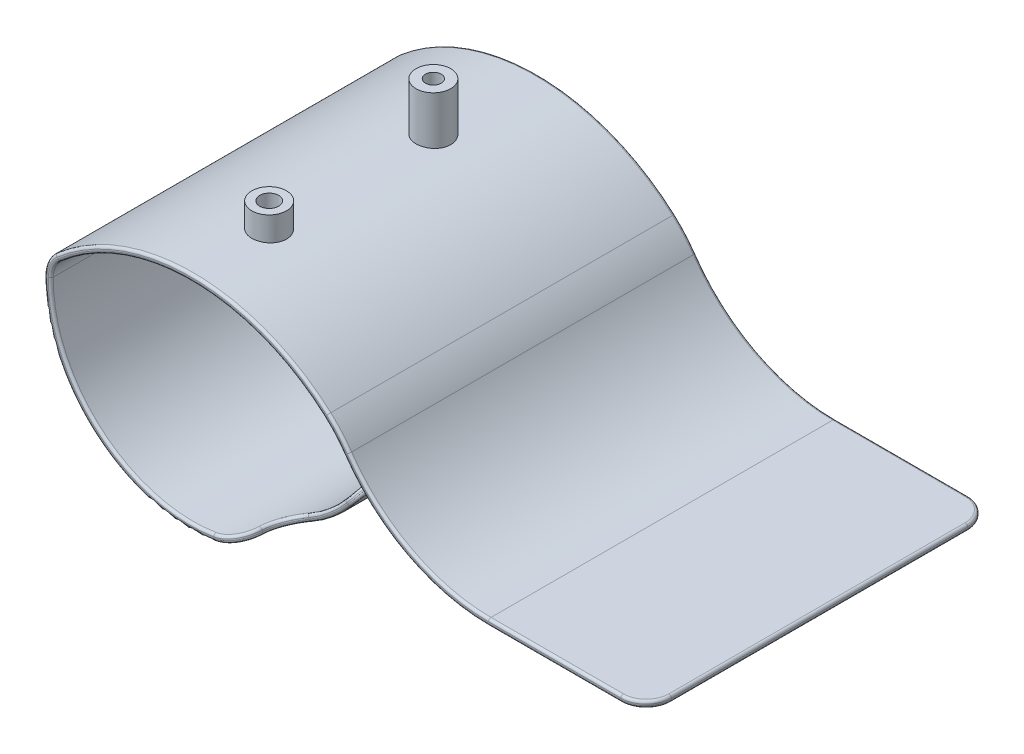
from build123d import *

# Parameters (mm, degrees)
EXTRUSION1_DEPTH        = 55
ENL_V_START             = -7.5
ENL_V_MAT_EXTRU_1_DEPTH = 7.5
CONG_1_R                = 4
CONG_2_R                = 4
CONG_3_R                = 4
CONG_4_R                = 4
CONG_5_R                = 0.4
EXTRUSION2_REACH        = 100.812
EXTRUSION2_END_RADIUS   = 32.8
ESQUISSE5_R             = 2.7500000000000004
ESQUISSE5_R_2           = 1.4999999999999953
EXTRUSION3_REACH        = 103.801
EXTRUSION3_END_RADIUS   = 32.8
EXTRUSION3_START        = 1
ESQUISSE6_R             = 2.7499999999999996
ESQUISSE6_R_2           = 1.2500000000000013


with BuildPart() as part:
    # Esquisse1 → Extrusion1 (new body)
    with BuildSketch(Plane.XY):
        with BuildLine():
            Line((47.24965884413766, -14.749664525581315), (72.24965884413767, -14.749664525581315))
            Line((72.24965884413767, -14.749664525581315), (72.24965884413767, -15.749664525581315))
            Line((72.24965884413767, -15.749664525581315), (47.249658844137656, -15.749664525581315))
            ThreePointArc((47.249658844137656, -15.749664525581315), (34.2829835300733, -12.538491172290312), (24.313458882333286, -3.647209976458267))
            ThreePointArc((24.313458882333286, -3.647209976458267), (22.85145480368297, -1.7648471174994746), (21.172517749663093, -0.07312721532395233))
            ThreePointArc((21.172517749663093, -0.07312721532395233), (0.24662429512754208, 7.999043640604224), (-20.80195524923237, 0.2524148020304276))
            ThreePointArc((-20.80195524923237, 0.2524148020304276), (-21.81265347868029, -1.087009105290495), (-22.185045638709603, -2.723129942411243))
            ThreePointArc((-22.185045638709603, -2.723129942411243), (-13.283174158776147, -20.771049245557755), (6.546609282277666, -24.198934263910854))
            ThreePointArc((6.546609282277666, -24.198934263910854), (7.002326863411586, -24.05279851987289), (7.454786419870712, -23.896867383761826))
            ThreePointArc((7.454786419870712, -23.896867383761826), (7.903777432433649, -23.731213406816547), (8.349090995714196, -23.555913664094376))
            ThreePointArc((8.349090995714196, -23.555913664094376), (13.455899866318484, -20.64062543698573), (17.617496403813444, -16.48616800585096))
            ThreePointArc((17.617496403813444, -16.48616800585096), (18.454723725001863, -15.315684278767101), (19.214309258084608, -14.093386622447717))
            Line((19.214309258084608, -14.093386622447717), (20.080334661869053, -14.593386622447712))
            ThreePointArc((20.080334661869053, -14.593386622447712), (19.286513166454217, -15.870775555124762), (18.41155042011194, -17.094015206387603))
            ThreePointArc((18.41155042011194, -17.094015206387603), (14.062382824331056, -21.435721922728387), (8.725400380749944, -24.482407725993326))
            ThreePointArc((8.725400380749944, -24.482407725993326), (8.260015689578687, -24.665608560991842), (7.7907877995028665, -24.83872887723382))
            ThreePointArc((7.7907877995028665, -24.83872887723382), (7.317935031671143, -25.001688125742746), (6.841677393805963, -25.154410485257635))
            ThreePointArc((6.841677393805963, -25.154410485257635), (-13.881872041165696, -21.57202418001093), (-23.184967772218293, -2.7106508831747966))
            ThreePointArc((-23.184967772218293, -2.7106508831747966), (-22.719477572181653, -0.6654998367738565), (-21.456104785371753, 1.0087800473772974))
            ThreePointArc((-21.456104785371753, 1.0087800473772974), (0.25437977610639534, 8.999013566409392), (21.83832019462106, 0.6730008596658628))
            ThreePointArc((21.83832019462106, 0.6730008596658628), (23.602611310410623, -1.1047229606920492), (25.13894097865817, -3.082781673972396))
            ThreePointArc((25.13894097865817, -3.082781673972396), (34.74965884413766, -11.654062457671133), (47.24965884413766, -14.749664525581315))
        make_face()
    extrude(amount=EXTRUSION1_DEPTH)

    # Esquisse2 → Enl_v. mat.-Extru.1 (cut)
    with BuildSketch(Plane.XY.offset(55).offset(ENL_V_START)):
        with BuildLine():
            Line((7.454786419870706, -23.896867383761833), (7.790787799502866, -24.83872887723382))
            ThreePointArc((7.790787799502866, -24.83872887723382), (14.847276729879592, -20.80968352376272), (20.080334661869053, -14.593386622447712))
            Line((20.080334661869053, -14.593386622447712), (19.214309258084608, -14.093386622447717))
            ThreePointArc((19.214309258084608, -14.093386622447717), (14.206942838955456, -20.041586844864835), (7.454786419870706, -23.896867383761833))
        make_face()
    extrude(amount=ENL_V_MAT_EXTRU_1_DEPTH, mode=Mode.SUBTRACT)

    # Cong_1
    cong_1_edges = [part.edges().sort_by_distance(p)[0] for p in [
        (19.64732195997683, -14.343386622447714, 0),
    ]]
    fillet(cong_1_edges, radius=CONG_1_R)

    # Cong_2
    cong_2_edges = [part.edges().sort_by_distance(p)[0] for p in [
        (7.622787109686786, -24.367798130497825, 55),
        (19.64732195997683, -14.343386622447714, 47.5),
    ]]
    fillet(cong_2_edges, radius=CONG_2_R)

    # Cong_3
    cong_3_edges = [part.edges().sort_by_distance(p)[0] for p in [
        (7.622787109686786, -24.367798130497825, 47.5),
    ]]
    fillet(cong_3_edges, radius=CONG_3_R)

    # Cong_4
    cong_4_edges = [part.edges().sort_by_distance(p)[0] for p in [
        (72.24965884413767, -15.249664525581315, 0),
        (72.24965884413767, -15.249664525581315, 55),
    ]]
    fillet(cong_4_edges, radius=CONG_4_R)

    # Cong_5
    cong_5_edges = [part.edges().sort_by_distance(p)[0] for p in [
        (0.2543797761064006, 8.999013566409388, 0),
        (-22.719477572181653, -0.6654998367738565, 0),
        (-8.053603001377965, -24.74318128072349, 0),
        (-21.81265347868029, -1.0870091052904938, 0),
        (0.24662429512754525, 7.999043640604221, 0),
        (-7.78838127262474, -23.774841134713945, 0),
        (18.597828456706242, -15.09849923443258, 1.164470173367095),
        (19.465357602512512, -15.598662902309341, 1.1650773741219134),
        (22.85145480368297, -1.7648471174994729, 0),
        (34.282983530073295, -12.538491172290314, 0),
        (20.080334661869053, -14.593386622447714, 23.75),
        (14.841178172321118, -20.814765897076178, 47.5),
        (19.465357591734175, -15.598662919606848, 46.334922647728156),
        (-14.47795086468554, -19.811955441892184, 55),
        (57.74965884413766, -15.749664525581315, 0),
        (19.214309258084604, -14.093386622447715, 23.75),
        (18.59782845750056, -15.098499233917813, 46.33552982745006),
        (6.247692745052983, -24.28894648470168, 53.92228506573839),
        (23.602611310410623, -1.104722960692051, 0),
        (6.5848188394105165, -25.232107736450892, 53.92170301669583),
        (34.74965884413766, -11.654062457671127, 0),
        (14.200835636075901, -20.046676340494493, 47.5),
        (8.622984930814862, -23.442530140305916, 48.57778479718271),
        (8.958931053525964, -24.386070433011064, 48.57836081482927),
        (34.74965884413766, -11.654062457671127, 55),
        (23.602611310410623, -1.104722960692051, 55),
        (0.2543797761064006, 8.999013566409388, 55),
        (-22.719477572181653, -0.6654998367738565, 55),
        (-15.060987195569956, -20.629325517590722, 55),
        (72.24965884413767, -15.749664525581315, 27.5),
        (72.24965884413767, -14.749664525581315, 27.5),
        (57.74965884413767, -14.749664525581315, 55),
        (-21.81265347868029, -1.0870091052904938, 55),
        (57.74965884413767, -14.749664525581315, 0),
        (71.07808596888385, -14.749664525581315, 53.82842712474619),
        (71.07808596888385, -14.749664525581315, 1.1715728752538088),
        (0.24662429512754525, 7.999043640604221, 55),
        (22.85145480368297, -1.7648471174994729, 55),
        (71.07808596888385, -15.749664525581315, 53.82842712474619),
        (34.282983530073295, -12.538491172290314, 55),
        (71.07808596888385, -15.749664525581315, 1.1715728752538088),
        (57.74965884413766, -15.749664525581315, 55),
    ]]
    fillet(cong_5_edges, radius=CONG_5_R)

    # Extrusion2: up to this cylinder (the profile starts outside it)
    extrusion2_end = Plane(origin=(9.85e-15, -23.800000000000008, 42.5), z_dir=(0, 0, -1)) * Cylinder(EXTRUSION2_END_RADIUS, 268.224, mode=Mode.PRIVATE)
    # Esquisse5 → Extrusion2 (add, up to the surface)
    with BuildSketch(Plane.XZ.offset(-12.783748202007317), mode=Mode.PRIVATE) as extrusion2_sk1:
        with Locations(Location((-0.04850414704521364, 42.50000000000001, 0), (0, 0, 180))):
            Circle(ESQUISSE5_R)
        with Locations(Location((-0.04850414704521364, 42.50000000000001, 0), (0, 0, 180))):
            Circle(ESQUISSE5_R_2, mode=Mode.SUBTRACT)
    extrusion2_tool1 = extrude(extrusion2_sk1.sketch, amount=EXTRUSION2_REACH, mode=Mode.PRIVATE) - extrusion2_end
    add(extrusion2_tool1.solids().sort_by_distance((2.623714, 12.783748, 42.5))[0])

    # Extrusion3: up to this cylinder (the profile starts outside it)
    extrusion3_end = Plane(origin=(9.85e-15, -23.800000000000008, 13.827781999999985), z_dir=(0, 0, -1)) * Cylinder(EXTRUSION3_END_RADIUS, 274.202, mode=Mode.PRIVATE)
    # Esquisse6 → Extrusion3 (add, up to the surface)
    with BuildSketch(Plane.XZ.offset(-17.583748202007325).offset(EXTRUSION3_START), mode=Mode.PRIVATE) as extrusion3_sk1:
        with Locations(Location((1.081e-14, 16.500000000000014, 0), (0, 0, 90))):
            Circle(ESQUISSE6_R)
        with Locations(Location((1.081e-14, 16.500000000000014, 0), (0, 0, 90))):
            Circle(ESQUISSE6_R_2, mode=Mode.SUBTRACT)
    extrusion3_tool1 = extrude(extrusion3_sk1.sketch, amount=EXTRUSION3_REACH, mode=Mode.PRIVATE) - extrusion3_end
    add(extrusion3_tool1.solids().sort_by_distance((0, 16.583748, 13.827782))[0])


solid = part.part
